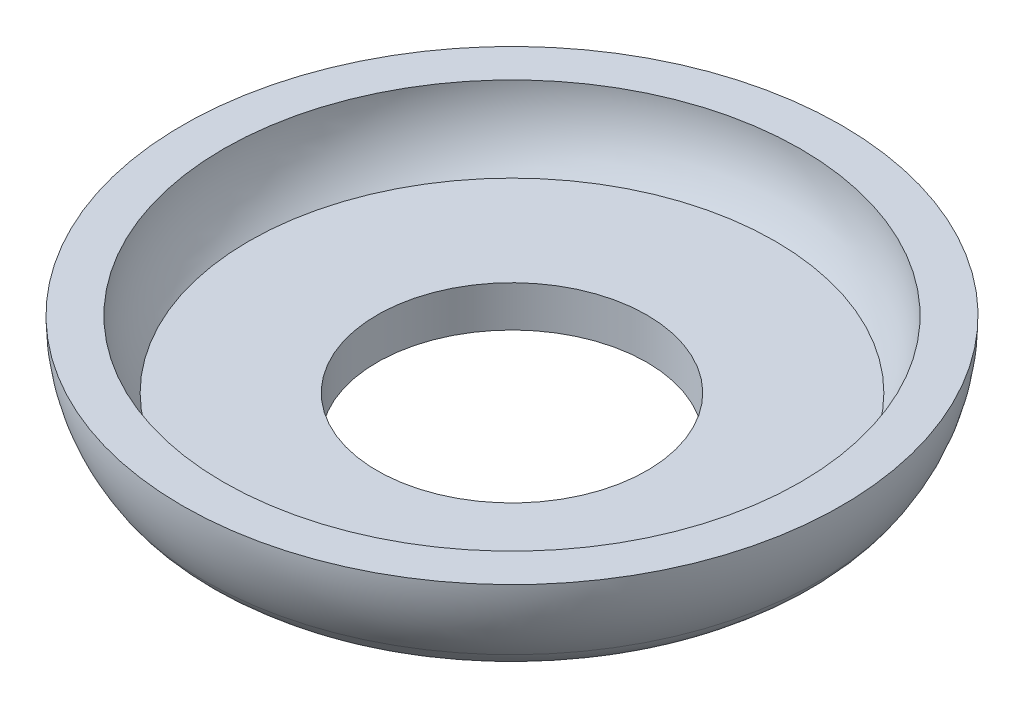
from build123d import *


with BuildPart() as part:
    # Sketch1 → Revolve1 (revolve)
    with BuildSketch(Plane.XY, mode=Mode.PRIVATE) as revolve1_sk:
        with BuildLine():
            Line((5.0165, 0), (9.280631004, 0))
            ThreePointArc((9.280631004, 0), (10.494721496, 0.308949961), (11.413463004, 1.160642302))
            ThreePointArc((11.413463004, 1.160642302), (12.040594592, 2.526079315), (12.2555, 4.0132))
            Line((12.2555, 4.0132), (10.7315, 4.0132))
            ThreePointArc((10.7315, 4.0132), (10.485243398, 2.680592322), (9.779, 1.524))
            Line((9.779, 1.524), (5.0165, 1.524))
            Line((5.0165, 1.524), (5.0165, 0))
        make_face()
    revolve(revolve1_sk.sketch.rotate(Axis((0, 0, 0), (0, 1, 0)), 90), axis=Axis((0, 0, 0), (0, 1, 0)))


solid = part.part
